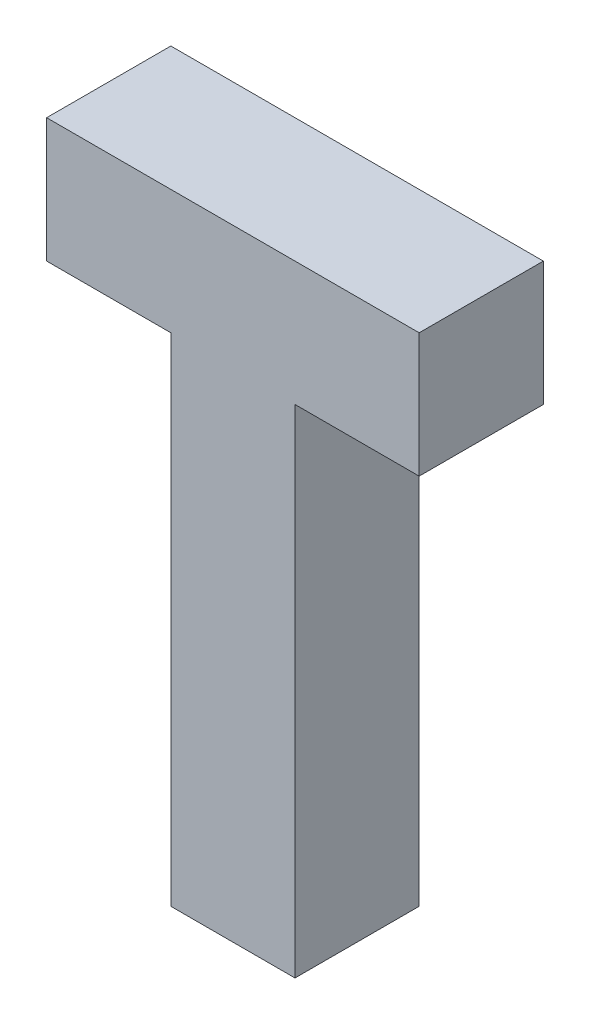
ISO-10303-21;
HEADER;
FILE_DESCRIPTION(('STEP AP214'),'2;1');
FILE_NAME('part.step','',(''),(''),'','','');
FILE_SCHEMA(('AUTOMOTIVE_DESIGN { 1 0 10303 214 1 1 1 1 }'));
ENDSEC;
DATA;
#1=APPLICATION_CONTEXT('core data for automotive mechanical design processes');
#2=APPLICATION_PROTOCOL_DEFINITION('international standard','automotive_design',2000,#1);
#3=PRODUCT_CONTEXT('',#1,'mechanical');
#4=PRODUCT('Part','Part','',(#3));
#5=PRODUCT_RELATED_PRODUCT_CATEGORY('part','',(#4));
#6=PRODUCT_DEFINITION_FORMATION('','',#4);
#7=PRODUCT_DEFINITION_CONTEXT('part definition',#1,'design');
#8=PRODUCT_DEFINITION('design','',#6,#7);
#9=PRODUCT_DEFINITION_SHAPE('','',#8);
#10=(LENGTH_UNIT() NAMED_UNIT(*) SI_UNIT(.MILLI.,.METRE.));
#11=(NAMED_UNIT(*) PLANE_ANGLE_UNIT() SI_UNIT($,.RADIAN.));
#12=(NAMED_UNIT(*) SI_UNIT($,.STERADIAN.) SOLID_ANGLE_UNIT());
#13=UNCERTAINTY_MEASURE_WITH_UNIT(LENGTH_MEASURE(1.E-05),#10,'distance_accuracy_value','');
#14=(GEOMETRIC_REPRESENTATION_CONTEXT(3) GLOBAL_UNCERTAINTY_ASSIGNED_CONTEXT((#13)) GLOBAL_UNIT_ASSIGNED_CONTEXT((#10,
#11,#12)) REPRESENTATION_CONTEXT('',''));
#15=CARTESIAN_POINT('',(0.,0.,0.));
#16=DIRECTION('',(0.,0.,1.));
#17=DIRECTION('',(1.,0.,0.));
#18=AXIS2_PLACEMENT_3D('',#15,#16,#17);
#19=CARTESIAN_POINT('',(0.,0.,10.));
#20=DIRECTION('',(1.,0.,0.));
#21=DIRECTION('',(0.,0.,-1.));
#22=AXIS2_PLACEMENT_3D('',#19,#20,#21);
#23=PLANE('',#22);
#24=DIRECTION('',(0.,-1.,0.));
#25=VECTOR('',#24,1.);
#26=CARTESIAN_POINT('',(0.,0.,0.));
#27=LINE('',#26,#25);
#28=CARTESIAN_POINT('',(0.,40.,0.));
#29=VERTEX_POINT('',#28);
#30=CARTESIAN_POINT('',(0.,0.,0.));
#31=VERTEX_POINT('',#30);
#32=EDGE_CURVE('E129',#29,#31,#27,.T.);
#33=ORIENTED_EDGE('',*,*,#32,.T.);
#34=DIRECTION('',(0.,0.,-1.));
#35=VECTOR('',#34,1.);
#36=CARTESIAN_POINT('',(0.,0.,10.));
#37=LINE('',#36,#35);
#38=CARTESIAN_POINT('',(0.,0.,10.));
#39=VERTEX_POINT('',#38);
#40=EDGE_CURVE('E11',#39,#31,#37,.T.);
#41=ORIENTED_EDGE('',*,*,#40,.F.);
#42=DIRECTION('',(0.,-1.,0.));
#43=VECTOR('',#42,1.);
#44=CARTESIAN_POINT('',(0.,0.,10.));
#45=LINE('',#44,#43);
#46=CARTESIAN_POINT('',(0.,40.,10.));
#47=VERTEX_POINT('',#46);
#48=EDGE_CURVE('E143',#47,#39,#45,.T.);
#49=ORIENTED_EDGE('',*,*,#48,.F.);
#50=DIRECTION('',(0.,0.,-1.));
#51=VECTOR('',#50,1.);
#52=CARTESIAN_POINT('',(0.,40.,10.));
#53=LINE('',#52,#51);
#54=EDGE_CURVE('E125',#47,#29,#53,.T.);
#55=ORIENTED_EDGE('',*,*,#54,.T.);
#56=EDGE_LOOP('',(#33,#41,#49,#55));
#57=FACE_BOUND('',#56,.T.);
#58=ADVANCED_FACE('F33',(#57),#23,.F.);
#59=CARTESIAN_POINT('',(0.,0.,10.));
#60=DIRECTION('',(0.,1.,0.));
#61=DIRECTION('',(0.,0.,1.));
#62=AXIS2_PLACEMENT_3D('',#59,#60,#61);
#63=PLANE('',#62);
#64=DIRECTION('',(1.,0.,0.));
#65=VECTOR('',#64,1.);
#66=CARTESIAN_POINT('',(0.,0.,0.));
#67=LINE('',#66,#65);
#68=CARTESIAN_POINT('',(10.,0.,0.));
#69=VERTEX_POINT('',#68);
#70=EDGE_CURVE('E132',#31,#69,#67,.T.);
#71=ORIENTED_EDGE('',*,*,#70,.T.);
#72=DIRECTION('',(0.,0.,-1.));
#73=VECTOR('',#72,1.);
#74=CARTESIAN_POINT('',(10.,0.,10.));
#75=LINE('',#74,#73);
#76=CARTESIAN_POINT('',(10.,0.,10.));
#77=VERTEX_POINT('',#76);
#78=EDGE_CURVE('E41',#77,#69,#75,.T.);
#79=ORIENTED_EDGE('',*,*,#78,.F.);
#80=DIRECTION('',(1.,0.,0.));
#81=VECTOR('',#80,1.);
#82=CARTESIAN_POINT('',(0.,0.,10.));
#83=LINE('',#82,#81);
#84=EDGE_CURVE('E92',#39,#77,#83,.T.);
#85=ORIENTED_EDGE('',*,*,#84,.F.);
#86=ORIENTED_EDGE('',*,*,#40,.T.);
#87=EDGE_LOOP('',(#71,#79,#85,#86));
#88=FACE_BOUND('',#87,.T.);
#89=ADVANCED_FACE('F178',(#88),#63,.F.);
#90=CARTESIAN_POINT('',(10.,0.,10.));
#91=DIRECTION('',(-1.,0.,0.));
#92=DIRECTION('',(0.,0.,1.));
#93=AXIS2_PLACEMENT_3D('',#90,#91,#92);
#94=PLANE('',#93);
#95=DIRECTION('',(0.,1.,0.));
#96=VECTOR('',#95,1.);
#97=CARTESIAN_POINT('',(10.,0.,0.));
#98=LINE('',#97,#96);
#99=CARTESIAN_POINT('',(10.,40.,0.));
#100=VERTEX_POINT('',#99);
#101=EDGE_CURVE('E134',#69,#100,#98,.T.);
#102=ORIENTED_EDGE('',*,*,#101,.T.);
#103=DIRECTION('',(0.,0.,-1.));
#104=VECTOR('',#103,1.);
#105=CARTESIAN_POINT('',(10.,40.,10.));
#106=LINE('',#105,#104);
#107=CARTESIAN_POINT('',(10.,40.,10.));
#108=VERTEX_POINT('',#107);
#109=EDGE_CURVE('E150',#108,#100,#106,.T.);
#110=ORIENTED_EDGE('',*,*,#109,.F.);
#111=DIRECTION('',(0.,1.,0.));
#112=VECTOR('',#111,1.);
#113=CARTESIAN_POINT('',(10.,0.,10.));
#114=LINE('',#113,#112);
#115=EDGE_CURVE('E158',#77,#108,#114,.T.);
#116=ORIENTED_EDGE('',*,*,#115,.F.);
#117=ORIENTED_EDGE('',*,*,#78,.T.);
#118=EDGE_LOOP('',(#102,#110,#116,#117));
#119=FACE_BOUND('',#118,.T.);
#120=ADVANCED_FACE('F156',(#119),#94,.F.);
#121=CARTESIAN_POINT('',(10.,40.,10.));
#122=DIRECTION('',(0.,1.,0.));
#123=DIRECTION('',(0.,0.,1.));
#124=AXIS2_PLACEMENT_3D('',#121,#122,#123);
#125=PLANE('',#124);
#126=DIRECTION('',(1.,0.,0.));
#127=VECTOR('',#126,1.);
#128=CARTESIAN_POINT('',(10.,40.,0.));
#129=LINE('',#128,#127);
#130=CARTESIAN_POINT('',(20.,40.,0.));
#131=VERTEX_POINT('',#130);
#132=EDGE_CURVE('E136',#100,#131,#129,.T.);
#133=ORIENTED_EDGE('',*,*,#132,.T.);
#134=DIRECTION('',(0.,0.,-1.));
#135=VECTOR('',#134,1.);
#136=CARTESIAN_POINT('',(20.,40.,10.));
#137=LINE('',#136,#135);
#138=CARTESIAN_POINT('',(20.,40.,10.));
#139=VERTEX_POINT('',#138);
#140=EDGE_CURVE('E147',#139,#131,#137,.T.);
#141=ORIENTED_EDGE('',*,*,#140,.F.);
#142=DIRECTION('',(1.,0.,0.));
#143=VECTOR('',#142,1.);
#144=CARTESIAN_POINT('',(10.,40.,10.));
#145=LINE('',#144,#143);
#146=EDGE_CURVE('E170',#108,#139,#145,.T.);
#147=ORIENTED_EDGE('',*,*,#146,.F.);
#148=ORIENTED_EDGE('',*,*,#109,.T.);
#149=EDGE_LOOP('',(#133,#141,#147,#148));
#150=FACE_BOUND('',#149,.T.);
#151=ADVANCED_FACE('F166',(#150),#125,.F.);
#152=CARTESIAN_POINT('',(20.,40.,10.));
#153=DIRECTION('',(-1.,0.,0.));
#154=DIRECTION('',(0.,-1.,0.));
#155=AXIS2_PLACEMENT_3D('',#152,#153,#154);
#156=PLANE('',#155);
#157=DIRECTION('',(0.,1.,0.));
#158=VECTOR('',#157,1.);
#159=CARTESIAN_POINT('',(20.,40.,0.));
#160=LINE('',#159,#158);
#161=CARTESIAN_POINT('',(20.,50.,0.));
#162=VERTEX_POINT('',#161);
#163=EDGE_CURVE('E138',#131,#162,#160,.T.);
#164=ORIENTED_EDGE('',*,*,#163,.T.);
#165=DIRECTION('',(0.,0.,-1.));
#166=VECTOR('',#165,1.);
#167=CARTESIAN_POINT('',(20.,50.,10.));
#168=LINE('',#167,#166);
#169=CARTESIAN_POINT('',(20.,50.,10.));
#170=VERTEX_POINT('',#169);
#171=EDGE_CURVE('E120',#170,#162,#168,.T.);
#172=ORIENTED_EDGE('',*,*,#171,.F.);
#173=DIRECTION('',(0.,1.,0.));
#174=VECTOR('',#173,1.);
#175=CARTESIAN_POINT('',(20.,40.,10.));
#176=LINE('',#175,#174);
#177=EDGE_CURVE('E111',#139,#170,#176,.T.);
#178=ORIENTED_EDGE('',*,*,#177,.F.);
#179=ORIENTED_EDGE('',*,*,#140,.T.);
#180=EDGE_LOOP('',(#164,#172,#178,#179));
#181=FACE_BOUND('',#180,.T.);
#182=ADVANCED_FACE('F169',(#181),#156,.F.);
#183=CARTESIAN_POINT('',(-10.,50.,10.));
#184=DIRECTION('',(0.,-1.,0.));
#185=DIRECTION('',(0.,0.,-1.));
#186=AXIS2_PLACEMENT_3D('',#183,#184,#185);
#187=PLANE('',#186);
#188=DIRECTION('',(-1.,0.,0.));
#189=VECTOR('',#188,1.);
#190=CARTESIAN_POINT('',(-10.,50.,0.));
#191=LINE('',#190,#189);
#192=CARTESIAN_POINT('',(-10.,50.,0.));
#193=VERTEX_POINT('',#192);
#194=EDGE_CURVE('E119',#162,#193,#191,.T.);
#195=ORIENTED_EDGE('',*,*,#194,.T.);
#196=DIRECTION('',(0.,0.,-1.));
#197=VECTOR('',#196,1.);
#198=CARTESIAN_POINT('',(-10.,50.,10.));
#199=LINE('',#198,#197);
#200=CARTESIAN_POINT('',(-10.,50.,10.));
#201=VERTEX_POINT('',#200);
#202=EDGE_CURVE('E116',#201,#193,#199,.T.);
#203=ORIENTED_EDGE('',*,*,#202,.F.);
#204=DIRECTION('',(-1.,0.,0.));
#205=VECTOR('',#204,1.);
#206=CARTESIAN_POINT('',(-10.,50.,10.));
#207=LINE('',#206,#205);
#208=EDGE_CURVE('E105',#170,#201,#207,.T.);
#209=ORIENTED_EDGE('',*,*,#208,.F.);
#210=ORIENTED_EDGE('',*,*,#171,.T.);
#211=EDGE_LOOP('',(#195,#203,#209,#210));
#212=FACE_BOUND('',#211,.T.);
#213=ADVANCED_FACE('F117',(#212),#187,.F.);
#214=CARTESIAN_POINT('',(-10.,40.,10.));
#215=DIRECTION('',(1.,0.,0.));
#216=DIRECTION('',(0.,1.,0.));
#217=AXIS2_PLACEMENT_3D('',#214,#215,#216);
#218=PLANE('',#217);
#219=DIRECTION('',(0.,-1.,0.));
#220=VECTOR('',#219,1.);
#221=CARTESIAN_POINT('',(-10.,40.,0.));
#222=LINE('',#221,#220);
#223=CARTESIAN_POINT('',(-10.,40.,0.));
#224=VERTEX_POINT('',#223);
#225=EDGE_CURVE('E78',#193,#224,#222,.T.);
#226=ORIENTED_EDGE('',*,*,#225,.T.);
#227=DIRECTION('',(0.,0.,-1.));
#228=VECTOR('',#227,1.);
#229=CARTESIAN_POINT('',(-10.,40.,10.));
#230=LINE('',#229,#228);
#231=CARTESIAN_POINT('',(-10.,40.,10.));
#232=VERTEX_POINT('',#231);
#233=EDGE_CURVE('E121',#232,#224,#230,.T.);
#234=ORIENTED_EDGE('',*,*,#233,.F.);
#235=DIRECTION('',(0.,-1.,0.));
#236=VECTOR('',#235,1.);
#237=CARTESIAN_POINT('',(-10.,40.,10.));
#238=LINE('',#237,#236);
#239=EDGE_CURVE('E109',#201,#232,#238,.T.);
#240=ORIENTED_EDGE('',*,*,#239,.F.);
#241=ORIENTED_EDGE('',*,*,#202,.T.);
#242=EDGE_LOOP('',(#226,#234,#240,#241));
#243=FACE_BOUND('',#242,.T.);
#244=ADVANCED_FACE('F123',(#243),#218,.F.);
#245=CARTESIAN_POINT('',(-10.,40.,10.));
#246=DIRECTION('',(0.,1.,0.));
#247=DIRECTION('',(0.,0.,1.));
#248=AXIS2_PLACEMENT_3D('',#245,#246,#247);
#249=PLANE('',#248);
#250=DIRECTION('',(1.,0.,0.));
#251=VECTOR('',#250,1.);
#252=CARTESIAN_POINT('',(-10.,40.,0.));
#253=LINE('',#252,#251);
#254=EDGE_CURVE('E84',#224,#29,#253,.T.);
#255=ORIENTED_EDGE('',*,*,#254,.T.);
#256=ORIENTED_EDGE('',*,*,#54,.F.);
#257=DIRECTION('',(1.,0.,0.));
#258=VECTOR('',#257,1.);
#259=CARTESIAN_POINT('',(-10.,40.,10.));
#260=LINE('',#259,#258);
#261=EDGE_CURVE('E49',#232,#47,#260,.T.);
#262=ORIENTED_EDGE('',*,*,#261,.F.);
#263=ORIENTED_EDGE('',*,*,#233,.T.);
#264=EDGE_LOOP('',(#255,#256,#262,#263));
#265=FACE_BOUND('',#264,.T.);
#266=ADVANCED_FACE('F194',(#265),#249,.F.);
#267=CARTESIAN_POINT('',(0.,0.,10.));
#268=DIRECTION('',(0.,0.,-1.));
#269=DIRECTION('',(-1.,0.,0.));
#270=AXIS2_PLACEMENT_3D('',#267,#268,#269);
#271=PLANE('',#270);
#272=ORIENTED_EDGE('',*,*,#48,.T.);
#273=ORIENTED_EDGE('',*,*,#84,.T.);
#274=ORIENTED_EDGE('',*,*,#115,.T.);
#275=ORIENTED_EDGE('',*,*,#146,.T.);
#276=ORIENTED_EDGE('',*,*,#177,.T.);
#277=ORIENTED_EDGE('',*,*,#208,.T.);
#278=ORIENTED_EDGE('',*,*,#239,.T.);
#279=ORIENTED_EDGE('',*,*,#261,.T.);
#280=EDGE_LOOP('',(#272,#273,#274,#275,#276,#277,#278,#279));
#281=FACE_BOUND('',#280,.T.);
#282=ADVANCED_FACE('F107',(#281),#271,.F.);
#283=CARTESIAN_POINT('',(0.,0.,0.));
#284=DIRECTION('',(0.,0.,-1.));
#285=DIRECTION('',(-1.,0.,0.));
#286=AXIS2_PLACEMENT_3D('',#283,#284,#285);
#287=PLANE('',#286);
#288=ORIENTED_EDGE('',*,*,#32,.F.);
#289=ORIENTED_EDGE('',*,*,#254,.F.);
#290=ORIENTED_EDGE('',*,*,#225,.F.);
#291=ORIENTED_EDGE('',*,*,#194,.F.);
#292=ORIENTED_EDGE('',*,*,#163,.F.);
#293=ORIENTED_EDGE('',*,*,#132,.F.);
#294=ORIENTED_EDGE('',*,*,#101,.F.);
#295=ORIENTED_EDGE('',*,*,#70,.F.);
#296=EDGE_LOOP('',(#288,#289,#290,#291,#292,#293,#294,#295));
#297=FACE_BOUND('',#296,.T.);
#298=ADVANCED_FACE('F162',(#297),#287,.T.);
#299=CLOSED_SHELL('',(#58,#89,#120,#151,#182,#213,#244,#266,#282,#298));
#300=MANIFOLD_SOLID_BREP('B2',#299);
#301=ADVANCED_BREP_SHAPE_REPRESENTATION('',(#18,#300),#14);
#302=SHAPE_DEFINITION_REPRESENTATION(#9,#301);
ENDSEC;
END-ISO-10303-21;
